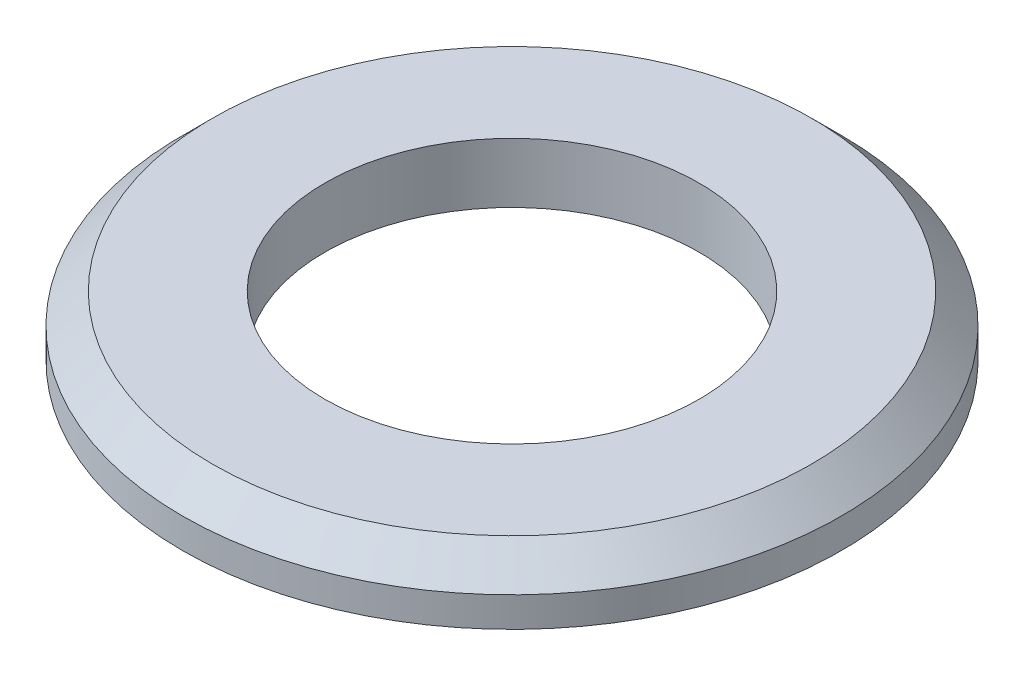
from build123d import *

# Parameters (mm, degrees)
SKETCH1_R      = 22
SKETCH1_R_2    = 12.5
EXTRUDE1_DEPTH = 4
CHAMFER1_SIZE  = 2


with BuildPart() as part:
    # Sketch1 → Extrude1 (new body)
    with BuildSketch(Plane(origin=(0, 0, 0), x_dir=(1, 0, 0), z_dir=(0, 1, 0))):
        with Locations(Location((0, 0, 0), (0, 0, 270))):
            Circle(SKETCH1_R)
        with Locations(Location((0, 0, 0), (0, 0, 270))):
            Circle(SKETCH1_R_2, mode=Mode.SUBTRACT)
    extrude(amount=EXTRUDE1_DEPTH)

    # Chamfer1
    chamfer1_edges = [part.edges().sort_by_distance(p)[0] for p in [
        (0, 4, -22),
    ]]
    chamfer(chamfer1_edges, length=CHAMFER1_SIZE)


solid = part.part
